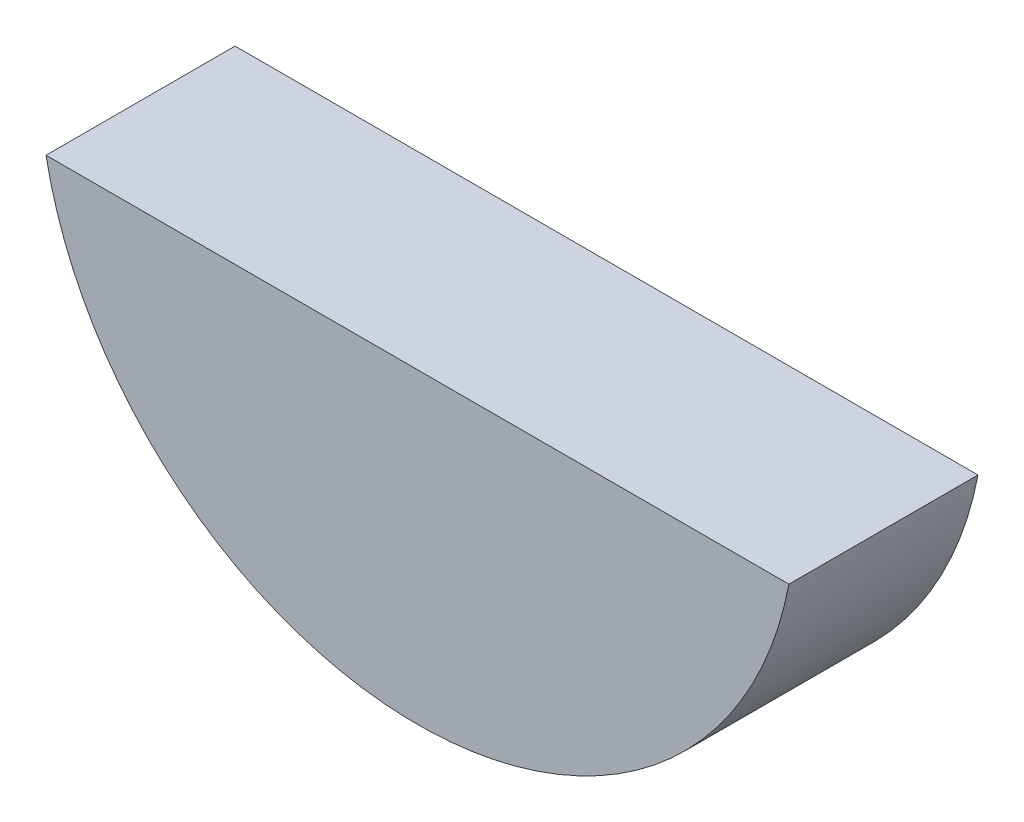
ISO-10303-21;
HEADER;
FILE_DESCRIPTION(('STEP AP214'),'2;1');
FILE_NAME('part.step','',(''),(''),'','','');
FILE_SCHEMA(('AUTOMOTIVE_DESIGN { 1 0 10303 214 1 1 1 1 }'));
ENDSEC;
DATA;
#1=APPLICATION_CONTEXT('core data for automotive mechanical design processes');
#2=APPLICATION_PROTOCOL_DEFINITION('international standard','automotive_design',2000,#1);
#3=PRODUCT_CONTEXT('',#1,'mechanical');
#4=PRODUCT('Part','Part','',(#3));
#5=PRODUCT_RELATED_PRODUCT_CATEGORY('part','',(#4));
#6=PRODUCT_DEFINITION_FORMATION('','',#4);
#7=PRODUCT_DEFINITION_CONTEXT('part definition',#1,'design');
#8=PRODUCT_DEFINITION('design','',#6,#7);
#9=PRODUCT_DEFINITION_SHAPE('','',#8);
#10=(LENGTH_UNIT() NAMED_UNIT(*) SI_UNIT(.MILLI.,.METRE.));
#11=(NAMED_UNIT(*) PLANE_ANGLE_UNIT() SI_UNIT($,.RADIAN.));
#12=(NAMED_UNIT(*) SI_UNIT($,.STERADIAN.) SOLID_ANGLE_UNIT());
#13=UNCERTAINTY_MEASURE_WITH_UNIT(LENGTH_MEASURE(1.E-05),#10,'distance_accuracy_value','');
#14=(GEOMETRIC_REPRESENTATION_CONTEXT(3) GLOBAL_UNCERTAINTY_ASSIGNED_CONTEXT((#13)) GLOBAL_UNIT_ASSIGNED_CONTEXT((#10,
#11,#12)) REPRESENTATION_CONTEXT('',''));
#15=CARTESIAN_POINT('',(0.,0.,0.));
#16=DIRECTION('',(0.,0.,1.));
#17=DIRECTION('',(1.,0.,0.));
#18=AXIS2_PLACEMENT_3D('',#15,#16,#17);
#19=CARTESIAN_POINT('',(1.55431223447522E-12,0.,1.58750000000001));
#20=DIRECTION('',(0.,0.,-1.));
#21=DIRECTION('',(-1.,0.,0.));
#22=AXIS2_PLACEMENT_3D('',#19,#20,#21);
#23=CYLINDRICAL_SURFACE('',#22,6.35);
#24=DIRECTION('',(0.,0.,-1.));
#25=VECTOR('',#24,1.);
#26=CARTESIAN_POINT('',(-6.2373802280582,-1.19062500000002,1.58749999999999));
#27=LINE('',#26,#25);
#28=CARTESIAN_POINT('',(-6.2373802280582,-1.19062500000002,1.58749999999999));
#29=VERTEX_POINT('',#28);
#30=CARTESIAN_POINT('',(-6.23738022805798,-1.19062500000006,-1.58749999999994));
#31=VERTEX_POINT('',#30);
#32=EDGE_CURVE('E39',#29,#31,#27,.T.);
#33=ORIENTED_EDGE('',*,*,#32,.T.);
#34=CARTESIAN_POINT('',(8.88178419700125E-13,0.,-1.58750000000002));
#35=DIRECTION('',(0.,0.,1.));
#36=DIRECTION('',(1.,0.,0.));
#37=AXIS2_PLACEMENT_3D('',#34,#35,#36);
#38=CIRCLE('',#37,6.35);
#39=CARTESIAN_POINT('',(6.23738022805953,-1.19062500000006,-1.58750000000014));
#40=VERTEX_POINT('',#39);
#41=EDGE_CURVE('E62',#31,#40,#38,.T.);
#42=ORIENTED_EDGE('',*,*,#41,.T.);
#43=DIRECTION('',(0.,0.,-1.));
#44=VECTOR('',#43,1.);
#45=CARTESIAN_POINT('',(6.23738022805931,-1.19062500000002,1.58749999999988));
#46=LINE('',#45,#44);
#47=CARTESIAN_POINT('',(6.23738022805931,-1.19062500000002,1.58749999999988));
#48=VERTEX_POINT('',#47);
#49=EDGE_CURVE('E11',#48,#40,#46,.T.);
#50=ORIENTED_EDGE('',*,*,#49,.F.);
#51=CARTESIAN_POINT('',(1.55431223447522E-12,0.,1.58750000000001));
#52=DIRECTION('',(0.,0.,1.));
#53=DIRECTION('',(1.,0.,0.));
#54=AXIS2_PLACEMENT_3D('',#51,#52,#53);
#55=CIRCLE('',#54,6.35);
#56=EDGE_CURVE('E66',#29,#48,#55,.T.);
#57=ORIENTED_EDGE('',*,*,#56,.F.);
#58=EDGE_LOOP('',(#33,#42,#50,#57));
#59=FACE_BOUND('',#58,.T.);
#60=ADVANCED_FACE('F32',(#59),#23,.T.);
#61=CARTESIAN_POINT('',(-6.2373802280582,-1.19062500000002,1.58749999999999));
#62=DIRECTION('',(0.,-1.,0.));
#63=DIRECTION('',(0.,0.,-1.));
#64=AXIS2_PLACEMENT_3D('',#61,#62,#63);
#65=PLANE('',#64);
#66=ORIENTED_EDGE('',*,*,#49,.T.);
#67=DIRECTION('',(-1.,0.,0.));
#68=VECTOR('',#67,1.);
#69=CARTESIAN_POINT('',(-6.23738022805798,-1.19062500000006,-1.58749999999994));
#70=LINE('',#69,#68);
#71=EDGE_CURVE('E58',#40,#31,#70,.T.);
#72=ORIENTED_EDGE('',*,*,#71,.T.);
#73=ORIENTED_EDGE('',*,*,#32,.F.);
#74=DIRECTION('',(-1.,0.,0.));
#75=VECTOR('',#74,1.);
#76=CARTESIAN_POINT('',(-6.2373802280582,-1.19062500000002,1.58749999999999));
#77=LINE('',#76,#75);
#78=EDGE_CURVE('E45',#48,#29,#77,.T.);
#79=ORIENTED_EDGE('',*,*,#78,.F.);
#80=EDGE_LOOP('',(#66,#72,#73,#79));
#81=FACE_BOUND('',#80,.T.);
#82=ADVANCED_FACE('F56',(#81),#65,.F.);
#83=CARTESIAN_POINT('',(1.55431223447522E-12,0.,1.58750000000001));
#84=DIRECTION('',(0.,0.,1.));
#85=DIRECTION('',(1.,0.,0.));
#86=AXIS2_PLACEMENT_3D('',#83,#84,#85);
#87=PLANE('',#86);
#88=ORIENTED_EDGE('',*,*,#56,.T.);
#89=ORIENTED_EDGE('',*,*,#78,.T.);
#90=EDGE_LOOP('',(#88,#89));
#91=FACE_BOUND('',#90,.T.);
#92=ADVANCED_FACE('F70',(#91),#87,.T.);
#93=CARTESIAN_POINT('',(8.88178419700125E-13,0.,-1.58750000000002));
#94=DIRECTION('',(0.,0.,1.));
#95=DIRECTION('',(1.,0.,0.));
#96=AXIS2_PLACEMENT_3D('',#93,#94,#95);
#97=PLANE('',#96);
#98=ORIENTED_EDGE('',*,*,#41,.F.);
#99=ORIENTED_EDGE('',*,*,#71,.F.);
#100=EDGE_LOOP('',(#98,#99));
#101=FACE_BOUND('',#100,.T.);
#102=ADVANCED_FACE('F65',(#101),#97,.F.);
#103=CLOSED_SHELL('',(#60,#82,#92,#102));
#104=MANIFOLD_SOLID_BREP('B2',#103);
#105=ADVANCED_BREP_SHAPE_REPRESENTATION('',(#18,#104),#14);
#106=SHAPE_DEFINITION_REPRESENTATION(#9,#105);
ENDSEC;
END-ISO-10303-21;
